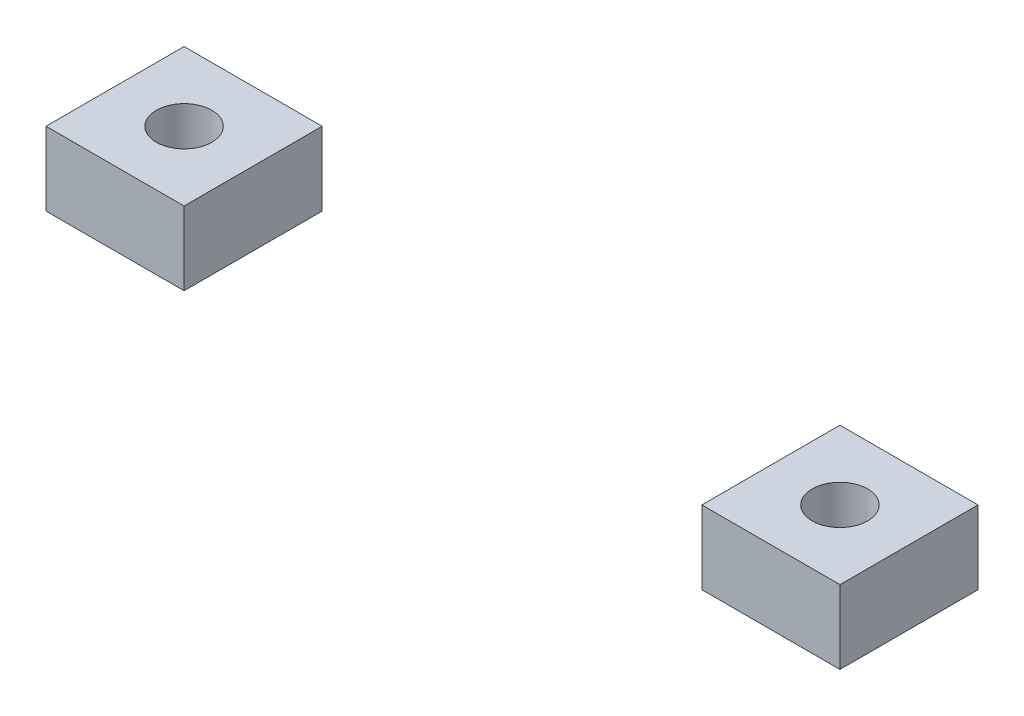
from build123d import *

# Parameters (mm, degrees)
SKETCH1_W             = 12.7
SKETCH1_H             = 12.7
SKETCH1_R             = 2.5527
BOSS_EXTRUDE1_DEPTH   = 6.7564
BOSS_EXTRUDE1_2_DEPTH = 6.7564


with BuildPart() as part:
    # Sketch1 → Boss-Extrude1 (new body)
    with BuildSketch(Plane(origin=(0, 0, 0), x_dir=(1, 0, 0), z_dir=(0, 1, 0))):
        with Locations((-30.1625, 0)):
            Rectangle(SKETCH1_W, SKETCH1_H)
        with Locations(Location((-30.1625, 0, 0), (0, 0, 270))):
            Circle(SKETCH1_R, mode=Mode.SUBTRACT)
    extrude(amount=BOSS_EXTRUDE1_DEPTH)


with BuildPart() as body_2:
    # Sketch1 → Boss-Extrude1 2 (new body)
    with BuildSketch(Plane(origin=(0, 0, 0), x_dir=(1, 0, 0), z_dir=(0, 1, 0))):
        with Locations((30.1625, 0)):
            Rectangle(SKETCH1_W, SKETCH1_H)
        with Locations(Location((30.1625, 0, 0), (0, 0, 270))):
            Circle(SKETCH1_R, mode=Mode.SUBTRACT)
    extrude(amount=BOSS_EXTRUDE1_2_DEPTH)


solid = Compound([part.part, body_2.part])
